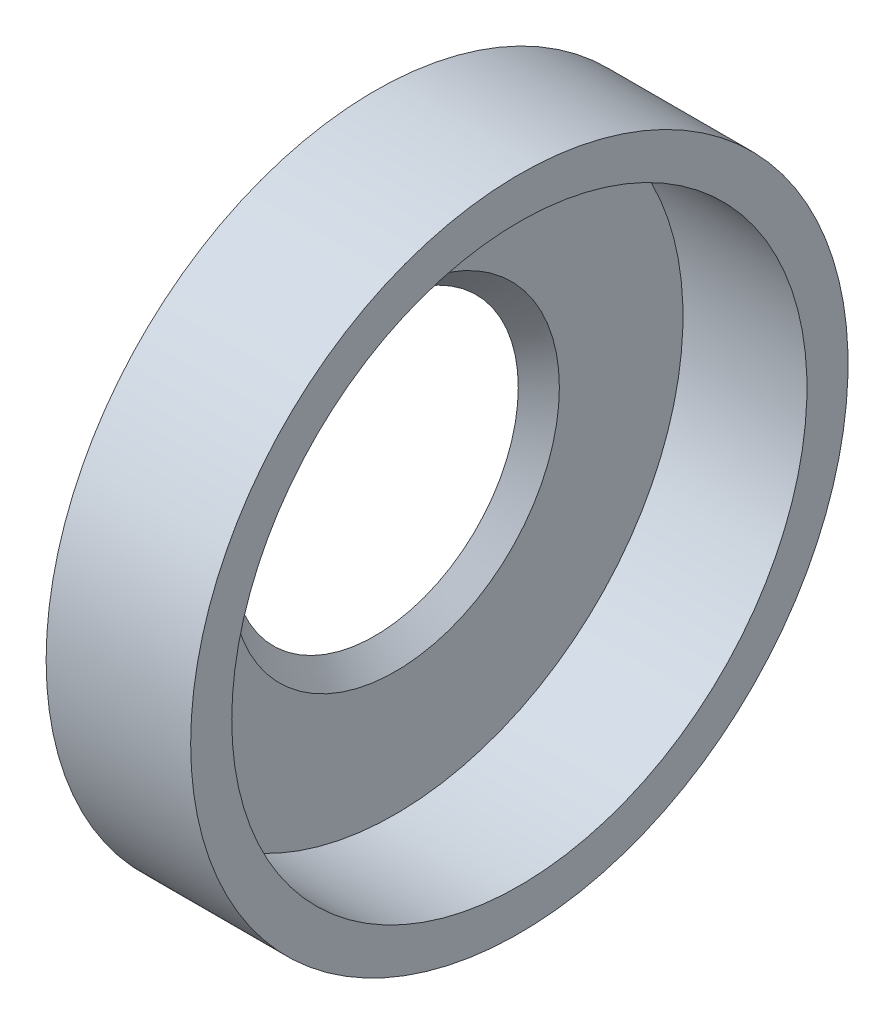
ISO-10303-21;
HEADER;
FILE_DESCRIPTION(('STEP AP214'),'2;1');
FILE_NAME('part.step','',(''),(''),'','','');
FILE_SCHEMA(('AUTOMOTIVE_DESIGN { 1 0 10303 214 1 1 1 1 }'));
ENDSEC;
DATA;
#1=APPLICATION_CONTEXT('core data for automotive mechanical design processes');
#2=APPLICATION_PROTOCOL_DEFINITION('international standard','automotive_design',2000,#1);
#3=PRODUCT_CONTEXT('',#1,'mechanical');
#4=PRODUCT('Part','Part','',(#3));
#5=PRODUCT_RELATED_PRODUCT_CATEGORY('part','',(#4));
#6=PRODUCT_DEFINITION_FORMATION('','',#4);
#7=PRODUCT_DEFINITION_CONTEXT('part definition',#1,'design');
#8=PRODUCT_DEFINITION('design','',#6,#7);
#9=PRODUCT_DEFINITION_SHAPE('','',#8);
#10=(LENGTH_UNIT() NAMED_UNIT(*) SI_UNIT(.MILLI.,.METRE.));
#11=(NAMED_UNIT(*) PLANE_ANGLE_UNIT() SI_UNIT($,.RADIAN.));
#12=(NAMED_UNIT(*) SI_UNIT($,.STERADIAN.) SOLID_ANGLE_UNIT());
#13=UNCERTAINTY_MEASURE_WITH_UNIT(LENGTH_MEASURE(1.E-05),#10,'distance_accuracy_value','');
#14=(GEOMETRIC_REPRESENTATION_CONTEXT(3) GLOBAL_UNCERTAINTY_ASSIGNED_CONTEXT((#13)) GLOBAL_UNIT_ASSIGNED_CONTEXT((#10,
#11,#12)) REPRESENTATION_CONTEXT('',''));
#15=CARTESIAN_POINT('',(0.,0.,0.));
#16=DIRECTION('',(0.,0.,1.));
#17=DIRECTION('',(1.,0.,0.));
#18=AXIS2_PLACEMENT_3D('',#15,#16,#17);
#19=CARTESIAN_POINT('',(0.,0.,0.));
#20=DIRECTION('',(1.,0.,0.));
#21=DIRECTION('',(0.,0.,-1.));
#22=AXIS2_PLACEMENT_3D('',#19,#20,#21);
#23=CONICAL_SURFACE('',#22,5.5426,0.785398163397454);
#24=CARTESIAN_POINT('',(0.793750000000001,0.,0.));
#25=DIRECTION('',(-1.,0.,0.));
#26=DIRECTION('',(0.,0.,1.));
#27=AXIS2_PLACEMENT_3D('',#24,#25,#26);
#28=CIRCLE('',#27,6.33635000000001);
#29=CARTESIAN_POINT('',(0.793750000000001,0.,6.33635000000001));
#30=VERTEX_POINT('',#29);
#31=EDGE_CURVE('E52',#30,#30,#28,.T.);
#32=ORIENTED_EDGE('',*,*,#31,.F.);
#33=EDGE_LOOP('',(#32));
#34=FACE_BOUND('',#33,.T.);
#35=CARTESIAN_POINT('',(0.,0.,0.));
#36=DIRECTION('',(-1.,0.,0.));
#37=DIRECTION('',(0.,0.,1.));
#38=AXIS2_PLACEMENT_3D('',#35,#36,#37);
#39=CIRCLE('',#38,5.5426);
#40=CARTESIAN_POINT('',(0.,0.,5.5426));
#41=VERTEX_POINT('',#40);
#42=EDGE_CURVE('E10',#41,#41,#39,.T.);
#43=ORIENTED_EDGE('',*,*,#42,.T.);
#44=EDGE_LOOP('',(#43));
#45=FACE_BOUND('',#44,.T.);
#46=ADVANCED_FACE('F30',(#34,#45),#23,.F.);
#47=CARTESIAN_POINT('',(0.,5.5426,0.));
#48=DIRECTION('',(1.,0.,0.));
#49=DIRECTION('',(0.,0.,-1.));
#50=AXIS2_PLACEMENT_3D('',#47,#48,#49);
#51=PLANE('',#50);
#52=ORIENTED_EDGE('',*,*,#42,.F.);
#53=EDGE_LOOP('',(#52));
#54=FACE_BOUND('',#53,.T.);
#55=CARTESIAN_POINT('',(0.,0.,0.));
#56=DIRECTION('',(-1.,0.,0.));
#57=DIRECTION('',(0.,0.,1.));
#58=AXIS2_PLACEMENT_3D('',#55,#56,#57);
#59=CIRCLE('',#58,12.7);
#60=CARTESIAN_POINT('',(0.,0.,12.7));
#61=VERTEX_POINT('',#60);
#62=EDGE_CURVE('E36',#61,#61,#59,.T.);
#63=ORIENTED_EDGE('',*,*,#62,.T.);
#64=EDGE_LOOP('',(#63));
#65=FACE_BOUND('',#64,.T.);
#66=ADVANCED_FACE('F59',(#54,#65),#51,.F.);
#67=CARTESIAN_POINT('',(0.,0.,0.));
#68=DIRECTION('',(-1.,0.,0.));
#69=DIRECTION('',(0.,0.,1.));
#70=AXIS2_PLACEMENT_3D('',#67,#68,#69);
#71=CYLINDRICAL_SURFACE('',#70,12.7);
#72=ORIENTED_EDGE('',*,*,#62,.F.);
#73=EDGE_LOOP('',(#72));
#74=FACE_BOUND('',#73,.T.);
#75=CARTESIAN_POINT('',(5.5842,0.,0.));
#76=DIRECTION('',(-1.,0.,0.));
#77=DIRECTION('',(0.,0.,1.));
#78=AXIS2_PLACEMENT_3D('',#75,#76,#77);
#79=CIRCLE('',#78,12.7);
#80=CARTESIAN_POINT('',(5.5842,0.,12.7));
#81=VERTEX_POINT('',#80);
#82=EDGE_CURVE('E40',#81,#81,#79,.T.);
#83=ORIENTED_EDGE('',*,*,#82,.T.);
#84=EDGE_LOOP('',(#83));
#85=FACE_BOUND('',#84,.T.);
#86=ADVANCED_FACE('F63',(#74,#85),#71,.T.);
#87=CARTESIAN_POINT('',(5.5842,12.7,0.));
#88=DIRECTION('',(-1.,0.,0.));
#89=DIRECTION('',(0.,0.,1.));
#90=AXIS2_PLACEMENT_3D('',#87,#88,#89);
#91=PLANE('',#90);
#92=ORIENTED_EDGE('',*,*,#82,.F.);
#93=EDGE_LOOP('',(#92));
#94=FACE_BOUND('',#93,.T.);
#95=CARTESIAN_POINT('',(5.5842,0.,0.));
#96=DIRECTION('',(-1.,0.,0.));
#97=DIRECTION('',(0.,0.,1.));
#98=AXIS2_PLACEMENT_3D('',#95,#96,#97);
#99=CIRCLE('',#98,11.1125);
#100=CARTESIAN_POINT('',(5.5842,0.,11.1125));
#101=VERTEX_POINT('',#100);
#102=EDGE_CURVE('E44',#101,#101,#99,.T.);
#103=ORIENTED_EDGE('',*,*,#102,.T.);
#104=EDGE_LOOP('',(#103));
#105=FACE_BOUND('',#104,.T.);
#106=ADVANCED_FACE('F68',(#94,#105),#91,.F.);
#107=CARTESIAN_POINT('',(0.,0.,0.));
#108=DIRECTION('',(-1.,0.,0.));
#109=DIRECTION('',(0.,0.,1.));
#110=AXIS2_PLACEMENT_3D('',#107,#108,#109);
#111=CYLINDRICAL_SURFACE('',#110,11.1125);
#112=ORIENTED_EDGE('',*,*,#102,.F.);
#113=EDGE_LOOP('',(#112));
#114=FACE_BOUND('',#113,.T.);
#115=CARTESIAN_POINT('',(0.79375,0.,0.));
#116=DIRECTION('',(-1.,0.,0.));
#117=DIRECTION('',(0.,0.,1.));
#118=AXIS2_PLACEMENT_3D('',#115,#116,#117);
#119=CIRCLE('',#118,11.1125);
#120=CARTESIAN_POINT('',(0.79375,0.,11.1125));
#121=VERTEX_POINT('',#120);
#122=EDGE_CURVE('E49',#121,#121,#119,.T.);
#123=ORIENTED_EDGE('',*,*,#122,.T.);
#124=EDGE_LOOP('',(#123));
#125=FACE_BOUND('',#124,.T.);
#126=ADVANCED_FACE('F74',(#114,#125),#111,.F.);
#127=CARTESIAN_POINT('',(0.79375,11.1125,0.));
#128=DIRECTION('',(-1.,0.,0.));
#129=DIRECTION('',(0.,0.,1.));
#130=AXIS2_PLACEMENT_3D('',#127,#128,#129);
#131=PLANE('',#130);
#132=ORIENTED_EDGE('',*,*,#122,.F.);
#133=EDGE_LOOP('',(#132));
#134=FACE_BOUND('',#133,.T.);
#135=ORIENTED_EDGE('',*,*,#31,.T.);
#136=EDGE_LOOP('',(#135));
#137=FACE_BOUND('',#136,.T.);
#138=ADVANCED_FACE('F56',(#134,#137),#131,.F.);
#139=CLOSED_SHELL('',(#46,#66,#86,#106,#126,#138));
#140=MANIFOLD_SOLID_BREP('B2',#139);
#141=ADVANCED_BREP_SHAPE_REPRESENTATION('',(#18,#140),#14);
#142=SHAPE_DEFINITION_REPRESENTATION(#9,#141);
ENDSEC;
END-ISO-10303-21;
